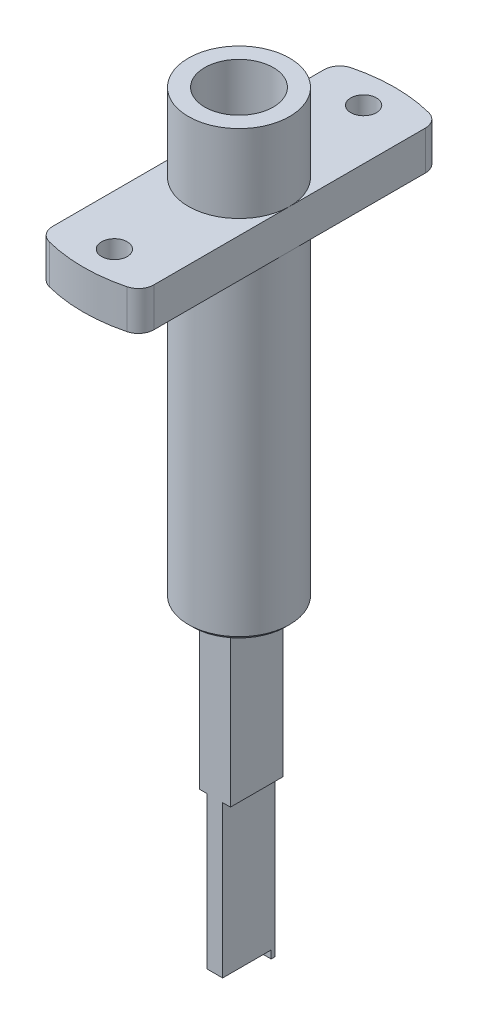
from build123d import *

# Parameters (mm, degrees)
SKETCH_1_W               = 6.5
SKETCH_1_H               = 95
SKETCH_9_R               = 12.5
CUT_EXTRUDE_6_DEPTH      = 8
SKETCH_10_R              = 20
SKETCH_10_R_2            = 4.458224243
EXTRUDE_1_DEPTH          = 5
HOLE_WIZARD_M4_1_D       = 3.3
HOLE_WIZARD_M4_1_DEPTH   = 11.5
HOLE_WIZARD_M4_1_TIP     = 0.991420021
SKETCH_15_W              = 20
SKETCH_15_H              = 40
CUT_EXTRUDE_7_DEPTH      = 10
SKETCH_16_R              = 6.5
EXTRUDE_2_DEPTH          = 10
SKETCH_17_R              = 6.5
SKETCH_17_R_2            = 5.5
CUT_EXTRUDE_8_DEPTH      = 40
HOLE_WIZARD_G1_8_1_D     = 8.8
HOLE_WIZARD_G1_8_1_DEPTH = 45
HOLE_WIZARD_G1_8_1_TIP   = 2.643786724
CUT_EXTRUDE_START        = -55
SKETCH_21_R              = 4.4
CUT_EXTRUDE_12_DEPTH     = 55
CUT_EXTRUDE_15_DEPTH     = 40
CUT_EXTRUDE_16_REACH     = 101.253
FILLET_1_R               = 2
EXTRUDE_START            = 0.5
SKETCH_27_W              = 1.5
SKETCH_27_H              = 5.2
EXTRUDE_3_DEPTH          = 0.5
CHAMFER_1_SIZE           = 0.5
SKETCH_28_W              = 4
SKETCH_28_H              = 0.5
EXTRUDE_4_DEPTH          = 40.5
CUT_EXTRUDE_17_DEPTH     = 40.5
SKETCH_30_W              = 4
SKETCH_30_H              = 1.023475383
CUT_EXTRUDE_18_DEPTH     = 0.5
SKETCH_31_W              = 1
SKETCH_31_H              = 9.723475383
CUT_EXTRUDE_19_DEPTH     = 20
SKETCH_32_W              = 2
SKETCH_32_H              = 2
EXTRUDE_5_DEPTH          = 1
CUT_EXTRUDE_START_2      = -0.5
SKETCH_33_W              = 2
SKETCH_33_H              = 0.5
CUT_EXTRUDE_20_DEPTH     = 0.5
SKETCH_34_W              = 0.5
SKETCH_34_H              = 5.2
EXTRUDE_6_DEPTH          = 0.5
CUT_EXTRUDE_START_3      = -41
SKETCH_35_W              = 4
SKETCH_35_H              = 1.5
CUT_EXTRUDE_21_DEPTH     = 41
CUT_EXTRUDE_START_4      = -1
SKETCH_36_W              = 0.5
SKETCH_36_H              = 0.5
SKETCH_36_H_2            = 0.476524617
CUT_EXTRUDE_22_DEPTH     = 1


with BuildPart() as part:
    # Sketch 1 → Revolve 1 (revolve)
    with BuildSketch(Plane.XY, mode=Mode.PRIVATE) as revolve_1_sk:
        with Locations((-3.25, -47.5)):
            Rectangle(SKETCH_1_W, SKETCH_1_H)
    revolve(revolve_1_sk.sketch.rotate(Axis((0, 78.734060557, 0), (0, -1, 0)), 270), axis=Axis((0, 78.734060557, 0), (0, -1, 0)))

    # Sketch 9 → Cut-Extrude 6 (cut)
    with BuildSketch(Plane(origin=(0, 0, 0), x_dir=(1, 0, 0), z_dir=(0, 1, 0))):
        Circle(SKETCH_9_R)
    extrude(amount=-CUT_EXTRUDE_6_DEPTH, mode=Mode.SUBTRACT)

    # Sketch 10 → Extrude 1 (add)
    with BuildSketch(Plane(origin=(0, -8, 0), x_dir=(1, 0, 0), z_dir=(0, 1, 0))):
        with Locations(Location((0, 0, 0), (0, 0, 270))):
            Circle(SKETCH_10_R)
        Circle(SKETCH_10_R_2, mode=Mode.SUBTRACT)
    extrude(amount=-EXTRUDE_1_DEPTH)

    # Hole Wizard M4 _1
    with Locations(Plane(origin=(0, -8, 0), x_dir=(1, 0, 0), z_dir=(0, 1, 0))):
        with Locations((0, -16), (0, 16)):
            Hole(HOLE_WIZARD_M4_1_D / 2, depth=HOLE_WIZARD_M4_1_DEPTH)
            with Locations((0, 0, -(HOLE_WIZARD_M4_1_DEPTH + HOLE_WIZARD_M4_1_TIP / 2))):  # 118° drill point
                Cone(0, HOLE_WIZARD_M4_1_D / 2, HOLE_WIZARD_M4_1_TIP, mode=Mode.SUBTRACT)

    # Sketch 15 → Cut-Extrude 7 (cut)
    with BuildSketch(Plane(origin=(0, -8, 0), x_dir=(1, 0, 0), z_dir=(0, 1, 0))):
        with Locations((16.5, 0)):
            Rectangle(SKETCH_15_W, SKETCH_15_H)
        with Locations((-16.5, 0)):
            Rectangle(SKETCH_15_W, SKETCH_15_H)
    extrude(amount=-CUT_EXTRUDE_7_DEPTH, mode=Mode.SUBTRACT)

    # Sketch 16 → Extrude 2 (add)
    with BuildSketch(Plane(origin=(0, -8, 0), x_dir=(1, 0, 0), z_dir=(0, 1, 0))):
        with Locations(Location((0, 0, 0), (0, 0, 270))):
            Circle(SKETCH_16_R)
    extrude(amount=EXTRUDE_2_DEPTH)

    # Sketch 17 → Cut-Extrude 8 (cut)
    with BuildSketch(Plane.XZ.offset(95)):
        Circle(SKETCH_17_R)
        with Locations(Location((0, 0, 0), (0, 0, 270))):
            Circle(SKETCH_17_R_2, mode=Mode.SUBTRACT)
    extrude(amount=-CUT_EXTRUDE_8_DEPTH, mode=Mode.SUBTRACT)

    # Hole Wizard G1_8 _1
    with Locations(Plane(origin=(0, 2, 0), x_dir=(1, 0, 0), z_dir=(0, 1, 0))):
        with Locations((0, 0)):
            Hole(HOLE_WIZARD_G1_8_1_D / 2, depth=HOLE_WIZARD_G1_8_1_DEPTH)
            with Locations((0, 0, -(HOLE_WIZARD_G1_8_1_DEPTH + HOLE_WIZARD_G1_8_1_TIP / 2))):  # 118° drill point
                Cone(0, HOLE_WIZARD_G1_8_1_D / 2, HOLE_WIZARD_G1_8_1_TIP, mode=Mode.SUBTRACT)

    # Sketch 21 → Cut-Extrude 12 (cut)
    with BuildSketch(Plane(origin=(0, 2, 0), x_dir=(1, 0, 0), z_dir=(0, 1, 0)).offset(CUT_EXTRUDE_START)):
        with Locations(Location((0, 0, 0), (0, 0, 270))):
            Circle(SKETCH_21_R)
    extrude(amount=CUT_EXTRUDE_12_DEPTH, mode=Mode.SUBTRACT)

    # Sketch 24 → Cut-Extrude 15 (cut)
    with BuildSketch(Plane.XZ.offset(95)):
        with BuildLine():
            Line((-2, 5.123475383), (-2, -5.123475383))
            ThreePointArc((-2, -5.123475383), (-5.5, 0), (-2, 5.123475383))
        make_face()
        with BuildLine():
            Line((2, 5.123475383), (2, -5.123475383))
            ThreePointArc((2, -5.123475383), (5.5, 0), (2, 5.123475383))
        make_face()
    extrude(amount=-CUT_EXTRUDE_15_DEPTH, mode=Mode.SUBTRACT)

    # Sketch 25 → Cut-Extrude 16 (cut, up to next)
    with BuildSketch(Plane.XZ.offset(95), mode=Mode.PRIVATE) as cut_extrude_16_sk1:
        with BuildLine():
            Line((-0.5, -1.5), (-0.5, 1.5))
            ThreePointArc((-0.5, 1.5), (0, 2), (0.5, 1.5))
            Line((0.5, 1.5), (0.5, -1.5))
            ThreePointArc((0.5, -1.5), (0, -2), (-0.5, -1.5))
        make_face()
    cut_extrude_16_tool1 = extrude(cut_extrude_16_sk1.sketch, amount=-CUT_EXTRUDE_16_REACH, mode=Mode.PRIVATE) & part.part
    add(cut_extrude_16_tool1.solids().sort_by_distance((0, -95, 0))[0], mode=Mode.SUBTRACT)

    # Fillet 1
    fillet_1_edges = [part.edges().sort_by_distance(p)[0] for p in [
        (-6.5, -10.5, -18.914280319),
        (-6.5, -10.5, 18.914280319),
        (6.5, -10.5, 18.914280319),
        (6.5, -10.5, -18.914280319),
    ]]
    fillet(fillet_1_edges, radius=FILLET_1_R)

    # Sketch 27 → Extrude 3 (add)
    with BuildSketch(Plane.XZ.offset(95).offset(EXTRUDE_START)):
        with BuildLine():
            Line((-2, 4.1), (2, 4.1))
            Line((2, 4.1), (2, 5.123475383))
            ThreePointArc((2, 5.123475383), (0, 5.5), (-2, 5.123475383))
            Line((-2, 5.123475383), (-2, 4.1))
        make_face()
        with Locations((-1.25, 0)):
            Rectangle(SKETCH_27_W, SKETCH_27_H)
        with BuildLine():
            Line((-2, -4.1), (2, -4.1))
            Line((2, -4.1), (2, -5.123475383))
            ThreePointArc((2, -5.123475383), (0, -5.5), (-2, -5.123475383))
            Line((-2, -5.123475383), (-2, -4.1))
        make_face()
    extrude(amount=-EXTRUDE_3_DEPTH)

    # Chamfer 1
    chamfer_1_edges = [part.edges().sort_by_distance(p)[0] for p in [
        (0, -55, -6.5),
    ]]
    chamfer(chamfer_1_edges, length=CHAMFER_1_SIZE)

    # Sketch 28 → Extrude 4 (add)
    with BuildSketch(Plane.XZ.offset(95.5)):
        with Locations((0, 4.35)):
            Rectangle(SKETCH_28_W, SKETCH_28_H)
        with Locations((0, -4.35)):
            Rectangle(SKETCH_28_W, SKETCH_28_H)
    extrude(amount=-EXTRUDE_4_DEPTH)

    # Sketch 29 → Cut-Extrude 17 (cut)
    with BuildSketch(Plane.XZ.offset(95.5)):
        with BuildLine():
            Line((2, 4.6), (-2, 4.6))
            Line((-2, 4.6), (-2, 5.123475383))
            ThreePointArc((-2, 5.123475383), (0, 5.5), (2, 5.123475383))
            Line((2, 5.123475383), (2, 4.6))
        make_face()
        with BuildLine():
            Line((2, -5.123475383), (-2, -5.123475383))
            ThreePointArc((-2, -5.123475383), (0, -5.5), (2, -5.123475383))
        make_face()
    extrude(amount=-CUT_EXTRUDE_17_DEPTH, mode=Mode.SUBTRACT)

    # Sketch 30 → Cut-Extrude 18 (cut)
    with BuildSketch(Plane.XZ.offset(95.5)):
        with Locations((0, -4.611737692)):
            Rectangle(SKETCH_30_W, SKETCH_30_H)
    extrude(amount=-CUT_EXTRUDE_18_DEPTH, mode=Mode.SUBTRACT)

    # Sketch 31 → Cut-Extrude 19 (cut)
    with BuildSketch(Plane.XZ.offset(95.5)):
        with Locations((-1.5, -0.261737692)):
            Rectangle(SKETCH_31_W, SKETCH_31_H)
        with Locations((1.5, -0.261737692)):
            Rectangle(SKETCH_31_W, SKETCH_31_H)
    extrude(amount=-CUT_EXTRUDE_19_DEPTH, mode=Mode.SUBTRACT)

    # Sketch 32 → Extrude 5 (add)
    with BuildSketch(Plane.XZ.offset(95)):
        with Locations((0, -4.123475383)):
            Rectangle(SKETCH_32_W, SKETCH_32_H)
    extrude(amount=EXTRUDE_5_DEPTH)

    # Sketch 33 → Cut-Extrude 20 (cut)
    with BuildSketch(Plane.XZ.offset(95.5).offset(CUT_EXTRUDE_START_2)):
        with Locations((0, 4.35)):
            Rectangle(SKETCH_33_W, SKETCH_33_H)
    extrude(amount=CUT_EXTRUDE_20_DEPTH, mode=Mode.SUBTRACT)

    # Sketch 34 → Extrude 6 (add)
    with BuildSketch(Plane.XZ.offset(95.5)):
        with Locations((-0.75, 0)):
            Rectangle(SKETCH_34_W, SKETCH_34_H)
    extrude(amount=EXTRUDE_6_DEPTH)

    # Sketch 35 → Cut-Extrude 21 (cut)
    with BuildSketch(Plane.XZ.offset(96).offset(CUT_EXTRUDE_START_3)):
        with Locations((0, -4.373475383)):
            Rectangle(SKETCH_35_W, SKETCH_35_H)
        with Locations((0, 3.85)):
            Rectangle(SKETCH_35_W, SKETCH_35_H)
    extrude(amount=CUT_EXTRUDE_21_DEPTH, mode=Mode.SUBTRACT)

    # Sketch 36 → Cut-Extrude 22 (cut)
    with BuildSketch(Plane.XZ.offset(96).offset(CUT_EXTRUDE_START_4)):
        with Locations((-0.75, 2.35)):
            Rectangle(SKETCH_36_W, SKETCH_36_H)
        with Locations((-0.75, -2.361737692)):
            Rectangle(SKETCH_36_W, SKETCH_36_H_2)
    extrude(amount=CUT_EXTRUDE_22_DEPTH, mode=Mode.SUBTRACT)


solid = part.part
